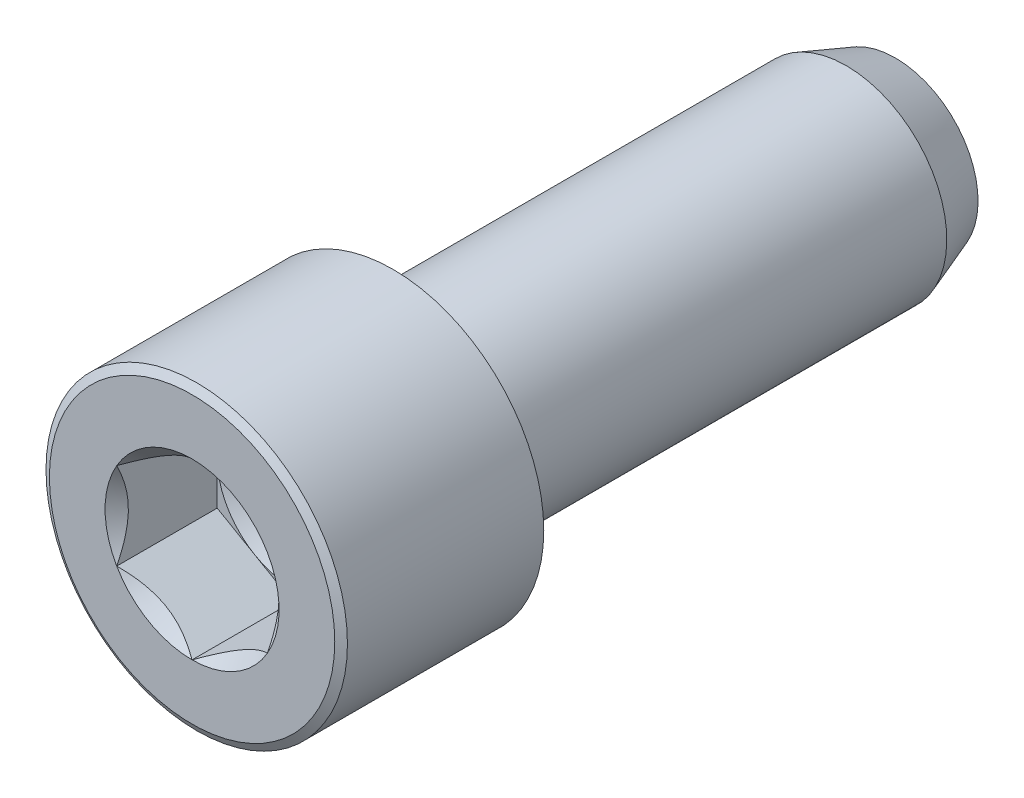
from build123d import *

# Parameters (mm, degrees)
SKETCH1_W          = 15.875
SKETCH1_H          = 3.175
SKETCH4_R          = 4.7625
EXTRUDE1_DEPTH     = 6.35
CHAMFER1_SIZE      = 0.254
CHAMFER1_SIZE2     = 0.146646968
CUT_EXTRUDE1_DEPTH = 3.175
SKETCH8_R          = 2.38125
CUT_EXTRUDE5_DEPTH = 1.058333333
CUT_EXTRUDE5_DRAFT = -60


with BuildPart() as part:
    # Sketch1 → Revolve1 (revolve)
    with BuildSketch(Plane(origin=(0, 0, 0), x_dir=(0, 0, -1), z_dir=(1, 0, 0))):
        with Locations((7.9375, 1.5875)):
            Rectangle(SKETCH1_W, SKETCH1_H)
    revolve(axis=Axis((0, 0, 0), (0, 0, 1)))

    # Sketch3 → Cut-Revolve2 (revolve, cut)
    with BuildSketch(Plane(origin=(0, 0, 0), x_dir=(0, 0, -1), z_dir=(1, 0, 0))):
        Polygon((15.875, 2.609908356), (14.322423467, 3.175), (15.875, 3.175), align=None)
    revolve(axis=Axis((0, 0, -14.322423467), (0, 0, 1)), mode=Mode.SUBTRACT)

    # Sketch4 → Extrude1 (add)
    with BuildSketch(Plane.XY):
        Circle(SKETCH4_R)
    extrude(amount=EXTRUDE1_DEPTH)

    # Chamfer1
    chamfer1_edges = [part.edges().sort_by_distance(p)[0] for p in [
        (-4.7625, 0, 6.35),
    ]]
    chamfer1_side = [part.faces().sort_by_distance(p)[0] for p in [
        (0, 0, 6.35),
    ]]
    chamfer(chamfer1_edges, length=CHAMFER1_SIZE, length2=CHAMFER1_SIZE2, reference=chamfer1_side[0])

    # Sketch6 → Cut-Extrude1 (cut)
    with BuildSketch(Plane.XY.offset(6.35)):
        Polygon((0, -2.749630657), (2.38125, -1.374815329), (2.38125, 1.374815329), (0, 2.749630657), (-2.38125, 1.374815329), (-2.38125, -1.374815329), align=None)
    extrude(amount=-CUT_EXTRUDE1_DEPTH, mode=Mode.SUBTRACT)

    # Cut-Extrude4 cone 1 section (on through the dimple's axis) → Cut-Extrude4 (revolve, cut)
    with BuildSketch(Plane(origin=(0, 0, 6.35), x_dir=(0, -1, 0), z_dir=(1, 0, 0))):
        Polygon((0, 0), (2.749630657, 0), (0, 2.749630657), align=None)
    revolve(axis=Axis((0, 0, 6.35), (0, 0, -1)), mode=Mode.SUBTRACT)


with BuildPart() as cut_extrude5_tool:
    # Sketch8 → Cut-Extrude5 (with draft: the straight prism first)
    with BuildSketch(Plane.XY.offset(3.175)):
        Circle(SKETCH8_R)
    extrude(amount=-CUT_EXTRUDE5_DEPTH)
    # Cut-Extrude5: the draft: its side faces are tilted about the plane it starts from
    cut_extrude5_sides = [cut_extrude5_tool.faces().sort_by_distance(p)[0] for p in [
        (-2.38125, 0, 2.645833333),
    ]]
    draft(cut_extrude5_sides, Plane.XY.offset(3.175), CUT_EXTRUDE5_DRAFT)


with BuildPart() as part_1:
    add(part.part)

    # Cut-Extrude5: cut by cut_extrude5_tool
    add(cut_extrude5_tool.part, mode=Mode.SUBTRACT)


solid = part_1.part
